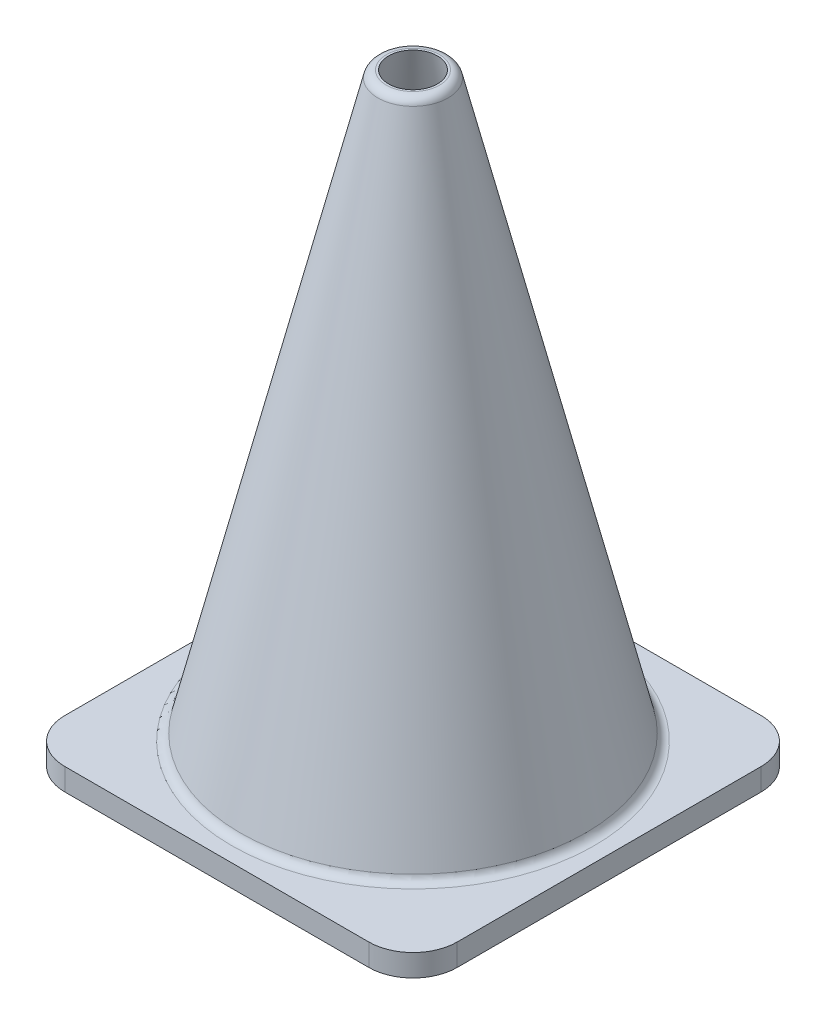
ISO-10303-21;
HEADER;
FILE_DESCRIPTION(('STEP AP214'),'2;1');
FILE_NAME('part.step','',(''),(''),'','','');
FILE_SCHEMA(('AUTOMOTIVE_DESIGN { 1 0 10303 214 1 1 1 1 }'));
ENDSEC;
DATA;
#1=APPLICATION_CONTEXT('core data for automotive mechanical design processes');
#2=APPLICATION_PROTOCOL_DEFINITION('international standard','automotive_design',2000,#1);
#3=PRODUCT_CONTEXT('',#1,'mechanical');
#4=PRODUCT('Part','Part','',(#3));
#5=PRODUCT_RELATED_PRODUCT_CATEGORY('part','',(#4));
#6=PRODUCT_DEFINITION_FORMATION('','',#4);
#7=PRODUCT_DEFINITION_CONTEXT('part definition',#1,'design');
#8=PRODUCT_DEFINITION('design','',#6,#7);
#9=PRODUCT_DEFINITION_SHAPE('','',#8);
#10=(LENGTH_UNIT() NAMED_UNIT(*) SI_UNIT(.MILLI.,.METRE.));
#11=(NAMED_UNIT(*) PLANE_ANGLE_UNIT() SI_UNIT($,.RADIAN.));
#12=(NAMED_UNIT(*) SI_UNIT($,.STERADIAN.) SOLID_ANGLE_UNIT());
#13=UNCERTAINTY_MEASURE_WITH_UNIT(LENGTH_MEASURE(1.E-05),#10,'distance_accuracy_value','');
#14=(GEOMETRIC_REPRESENTATION_CONTEXT(3) GLOBAL_UNCERTAINTY_ASSIGNED_CONTEXT((#13)) GLOBAL_UNIT_ASSIGNED_CONTEXT((#10,
#11,#12)) REPRESENTATION_CONTEXT('',''));
#15=CARTESIAN_POINT('',(0.,0.,0.));
#16=DIRECTION('',(0.,0.,1.));
#17=DIRECTION('',(1.,0.,0.));
#18=AXIS2_PLACEMENT_3D('',#15,#16,#17);
#19=CARTESIAN_POINT('',(0.,50.8,0.));
#20=DIRECTION('',(0.,-1.,0.));
#21=DIRECTION('',(0.,0.,-1.));
#22=AXIS2_PLACEMENT_3D('',#19,#20,#21);
#23=PLANE('',#22);
#24=CARTESIAN_POINT('',(0.,50.8,0.));
#25=DIRECTION('',(0.,-1.,0.));
#26=DIRECTION('',(0.,0.,-1.));
#27=AXIS2_PLACEMENT_3D('',#24,#25,#26);
#28=CIRCLE('',#27,2.31873017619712);
#29=CARTESIAN_POINT('',(0.,50.8,-2.31873017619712));
#30=VERTEX_POINT('',#29);
#31=EDGE_CURVE('E270',#30,#30,#28,.F.);
#32=ORIENTED_EDGE('',*,*,#31,.T.);
#33=EDGE_LOOP('',(#32));
#34=FACE_BOUND('',#33,.T.);
#35=CARTESIAN_POINT('',(0.,50.8,0.));
#36=DIRECTION('',(0.,-1.,0.));
#37=DIRECTION('',(0.,0.,-1.));
#38=AXIS2_PLACEMENT_3D('',#35,#36,#37);
#39=CIRCLE('',#38,2.13155859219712);
#40=CARTESIAN_POINT('',(0.,50.8,-2.13155859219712));
#41=VERTEX_POINT('',#40);
#42=EDGE_CURVE('E195',#41,#41,#39,.F.);
#43=ORIENTED_EDGE('',*,*,#42,.F.);
#44=EDGE_LOOP('',(#43));
#45=FACE_BOUND('',#44,.T.);
#46=ADVANCED_FACE('F32',(#34,#45),#23,.F.);
#47=CARTESIAN_POINT('',(17.145,-1.9304,-17.145));
#48=DIRECTION('',(0.,1.,0.));
#49=DIRECTION('',(0.,0.,1.));
#50=AXIS2_PLACEMENT_3D('',#47,#48,#49);
#51=PLANE('',#50);
#52=DIRECTION('',(-1.,0.,0.));
#53=VECTOR('',#52,1.);
#54=CARTESIAN_POINT('',(17.145,-1.9304,17.145));
#55=LINE('',#54,#53);
#56=CARTESIAN_POINT('',(13.2842,-1.9304,17.145));
#57=VERTEX_POINT('',#56);
#58=CARTESIAN_POINT('',(-13.2842,-1.9304,17.145));
#59=VERTEX_POINT('',#58);
#60=EDGE_CURVE('E217',#57,#59,#55,.T.);
#61=ORIENTED_EDGE('',*,*,#60,.T.);
#62=CARTESIAN_POINT('',(-13.2842,-1.9304,13.2842));
#63=DIRECTION('',(0.,1.,0.));
#64=DIRECTION('',(0.,0.,1.));
#65=AXIS2_PLACEMENT_3D('',#62,#63,#64);
#66=CIRCLE('',#65,3.8608);
#67=CARTESIAN_POINT('',(-17.145,-1.9304,13.2842));
#68=VERTEX_POINT('',#67);
#69=EDGE_CURVE('E259',#59,#68,#66,.F.);
#70=ORIENTED_EDGE('',*,*,#69,.T.);
#71=DIRECTION('',(0.,0.,-1.));
#72=VECTOR('',#71,1.);
#73=CARTESIAN_POINT('',(-17.145,-1.9304,17.145));
#74=LINE('',#73,#72);
#75=CARTESIAN_POINT('',(-17.145,-1.9304,-13.2842));
#76=VERTEX_POINT('',#75);
#77=EDGE_CURVE('E221',#68,#76,#74,.T.);
#78=ORIENTED_EDGE('',*,*,#77,.T.);
#79=CARTESIAN_POINT('',(-13.2842,-1.9304,-13.2842));
#80=DIRECTION('',(0.,1.,0.));
#81=DIRECTION('',(0.,0.,1.));
#82=AXIS2_PLACEMENT_3D('',#79,#80,#81);
#83=CIRCLE('',#82,3.8608);
#84=CARTESIAN_POINT('',(-13.2842,-1.9304,-17.145));
#85=VERTEX_POINT('',#84);
#86=EDGE_CURVE('E253',#76,#85,#83,.F.);
#87=ORIENTED_EDGE('',*,*,#86,.T.);
#88=DIRECTION('',(1.,0.,0.));
#89=VECTOR('',#88,1.);
#90=CARTESIAN_POINT('',(17.145,-1.9304,-17.145));
#91=LINE('',#90,#89);
#92=CARTESIAN_POINT('',(13.2842,-1.9304,-17.145));
#93=VERTEX_POINT('',#92);
#94=EDGE_CURVE('E224',#85,#93,#91,.T.);
#95=ORIENTED_EDGE('',*,*,#94,.T.);
#96=CARTESIAN_POINT('',(13.2842,-1.9304,-13.2842));
#97=DIRECTION('',(0.,1.,0.));
#98=DIRECTION('',(0.,0.,1.));
#99=AXIS2_PLACEMENT_3D('',#96,#97,#98);
#100=CIRCLE('',#99,3.8608);
#101=CARTESIAN_POINT('',(17.145,-1.9304,-13.2842));
#102=VERTEX_POINT('',#101);
#103=EDGE_CURVE('E255',#93,#102,#100,.F.);
#104=ORIENTED_EDGE('',*,*,#103,.T.);
#105=DIRECTION('',(0.,0.,1.));
#106=VECTOR('',#105,1.);
#107=CARTESIAN_POINT('',(17.145,-1.9304,17.145));
#108=LINE('',#107,#106);
#109=CARTESIAN_POINT('',(17.145,-1.9304,13.2842));
#110=VERTEX_POINT('',#109);
#111=EDGE_CURVE('E214',#102,#110,#108,.T.);
#112=ORIENTED_EDGE('',*,*,#111,.T.);
#113=CARTESIAN_POINT('',(13.2842,-1.9304,13.2842));
#114=DIRECTION('',(0.,1.,0.));
#115=DIRECTION('',(0.,0.,1.));
#116=AXIS2_PLACEMENT_3D('',#113,#114,#115);
#117=CIRCLE('',#116,3.8608);
#118=EDGE_CURVE('E257',#110,#57,#117,.F.);
#119=ORIENTED_EDGE('',*,*,#118,.T.);
#120=EDGE_LOOP('',(#61,#70,#78,#87,#95,#104,#112,#119));
#121=FACE_BOUND('',#120,.T.);
#122=DIRECTION('',(-1.,0.,0.));
#123=VECTOR('',#122,1.);
#124=CARTESIAN_POINT('',(17.145,-1.9304,16.37284));
#125=LINE('',#124,#123);
#126=CARTESIAN_POINT('',(13.2842,-1.9304,16.37284));
#127=VERTEX_POINT('',#126);
#128=CARTESIAN_POINT('',(-13.2842,-1.9304,16.37284));
#129=VERTEX_POINT('',#128);
#130=EDGE_CURVE('E174',#127,#129,#125,.T.);
#131=ORIENTED_EDGE('',*,*,#130,.F.);
#132=CARTESIAN_POINT('',(13.2842,-1.9304,13.2842));
#133=DIRECTION('',(0.,1.,0.));
#134=DIRECTION('',(0.,0.,1.));
#135=AXIS2_PLACEMENT_3D('',#132,#133,#134);
#136=CIRCLE('',#135,3.08864);
#137=CARTESIAN_POINT('',(16.37284,-1.9304,13.2842));
#138=VERTEX_POINT('',#137);
#139=EDGE_CURVE('E202',#138,#127,#136,.F.);
#140=ORIENTED_EDGE('',*,*,#139,.F.);
#141=DIRECTION('',(0.,0.,1.));
#142=VECTOR('',#141,1.);
#143=CARTESIAN_POINT('',(16.37284,-1.9304,-17.145));
#144=LINE('',#143,#142);
#145=CARTESIAN_POINT('',(16.37284,-1.9304,-13.2842));
#146=VERTEX_POINT('',#145);
#147=EDGE_CURVE('E47',#146,#138,#144,.T.);
#148=ORIENTED_EDGE('',*,*,#147,.F.);
#149=CARTESIAN_POINT('',(13.2842,-1.9304,-13.2842));
#150=DIRECTION('',(0.,1.,0.));
#151=DIRECTION('',(0.,0.,1.));
#152=AXIS2_PLACEMENT_3D('',#149,#150,#151);
#153=CIRCLE('',#152,3.08864);
#154=CARTESIAN_POINT('',(13.2842,-1.9304,-16.37284));
#155=VERTEX_POINT('',#154);
#156=EDGE_CURVE('E178',#155,#146,#153,.F.);
#157=ORIENTED_EDGE('',*,*,#156,.F.);
#158=DIRECTION('',(1.,0.,0.));
#159=VECTOR('',#158,1.);
#160=CARTESIAN_POINT('',(17.145,-1.9304,-16.37284));
#161=LINE('',#160,#159);
#162=CARTESIAN_POINT('',(-13.2842,-1.9304,-16.37284));
#163=VERTEX_POINT('',#162);
#164=EDGE_CURVE('E187',#163,#155,#161,.T.);
#165=ORIENTED_EDGE('',*,*,#164,.F.);
#166=CARTESIAN_POINT('',(-13.2842,-1.9304,-13.2842));
#167=DIRECTION('',(0.,1.,0.));
#168=DIRECTION('',(0.,0.,1.));
#169=AXIS2_PLACEMENT_3D('',#166,#167,#168);
#170=CIRCLE('',#169,3.08864);
#171=CARTESIAN_POINT('',(-16.37284,-1.9304,-13.2842));
#172=VERTEX_POINT('',#171);
#173=EDGE_CURVE('E176',#172,#163,#170,.F.);
#174=ORIENTED_EDGE('',*,*,#173,.F.);
#175=DIRECTION('',(0.,0.,-1.));
#176=VECTOR('',#175,1.);
#177=CARTESIAN_POINT('',(-16.37284,-1.9304,-17.145));
#178=LINE('',#177,#176);
#179=CARTESIAN_POINT('',(-16.37284,-1.9304,13.2842));
#180=VERTEX_POINT('',#179);
#181=EDGE_CURVE('E206',#180,#172,#178,.T.);
#182=ORIENTED_EDGE('',*,*,#181,.F.);
#183=CARTESIAN_POINT('',(-13.2842,-1.9304,13.2842));
#184=DIRECTION('',(0.,1.,0.));
#185=DIRECTION('',(0.,0.,1.));
#186=AXIS2_PLACEMENT_3D('',#183,#184,#185);
#187=CIRCLE('',#186,3.08864);
#188=EDGE_CURVE('E204',#129,#180,#187,.F.);
#189=ORIENTED_EDGE('',*,*,#188,.F.);
#190=EDGE_LOOP('',(#131,#140,#148,#157,#165,#174,#182,#189));
#191=FACE_BOUND('',#190,.T.);
#192=ADVANCED_FACE('F289',(#121,#191),#51,.F.);
#193=CARTESIAN_POINT('',(0.,0.,0.));
#194=DIRECTION('',(0.,-1.,0.));
#195=DIRECTION('',(0.,0.,-1.));
#196=AXIS2_PLACEMENT_3D('',#193,#194,#195);
#197=CONICAL_SURFACE('',#196,15.24,0.23781303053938);
#198=CARTESIAN_POINT('',(0.,50.2097437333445,0.));
#199=DIRECTION('',(0.,1.,0.));
#200=DIRECTION('',(0.,0.,1.));
#201=AXIS2_PLACEMENT_3D('',#198,#199,#200);
#202=CIRCLE('',#201,3.0691581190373);
#203=CARTESIAN_POINT('',(0.,50.2097437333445,-3.06915811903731));
#204=VERTEX_POINT('',#203);
#205=EDGE_CURVE('E40',#204,#204,#202,.F.);
#206=CARTESIAN_POINT('',(0.,0.590256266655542,0.));
#207=DIRECTION('',(0.,1.,0.));
#208=DIRECTION('',(0.,0.,1.));
#209=AXIS2_PLACEMENT_3D('',#206,#207,#208);
#210=CIRCLE('',#209,15.0969218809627);
#211=CARTESIAN_POINT('',(0.,0.590256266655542,-15.0969218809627));
#212=VERTEX_POINT('',#211);
#213=EDGE_CURVE('E273',#212,#212,#210,.T.);
#214=CARTESIAN_POINT('',(0.,50.2097437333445,-3.06915811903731));
#215=CARTESIAN_POINT('',(0.,49.6928740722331,-3.19444732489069));
#216=CARTESIAN_POINT('',(0.,49.1760044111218,-3.31973653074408));
#217=CARTESIAN_POINT('',(0.,48.1422650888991,-3.57031494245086));
#218=CARTESIAN_POINT('',(0.,47.6253954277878,-3.69560414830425));
#219=CARTESIAN_POINT('',(0.,46.5916561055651,-3.94618256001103));
#220=CARTESIAN_POINT('',(0.,46.0747864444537,-4.07147176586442));
#221=CARTESIAN_POINT('',(0.,45.041047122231,-4.3220501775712));
#222=CARTESIAN_POINT('',(0.,44.5241774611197,-4.44733938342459));
#223=CARTESIAN_POINT('',(0.,43.490438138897,-4.69791779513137));
#224=CARTESIAN_POINT('',(0.,42.9735684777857,-4.82320700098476));
#225=CARTESIAN_POINT('',(0.,41.939829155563,-5.07378541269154));
#226=CARTESIAN_POINT('',(0.,41.4229594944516,-5.19907461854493));
#227=CARTESIAN_POINT('',(0.,40.389220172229,-5.44965303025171));
#228=CARTESIAN_POINT('',(0.,39.8723505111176,-5.5749422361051));
#229=CARTESIAN_POINT('',(0.,38.8386111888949,-5.82552064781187));
#230=CARTESIAN_POINT('',(0.,38.3217415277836,-5.95080985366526));
#231=CARTESIAN_POINT('',(0.,37.2880022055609,-6.20138826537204));
#232=CARTESIAN_POINT('',(0.,36.7711325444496,-6.32667747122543));
#233=CARTESIAN_POINT('',(0.,35.7373932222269,-6.57725588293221));
#234=CARTESIAN_POINT('',(0.,35.2205235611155,-6.7025450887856));
#235=CARTESIAN_POINT('',(0.,34.1867842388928,-6.95312350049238));
#236=CARTESIAN_POINT('',(0.,33.6699145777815,-7.07841270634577));
#237=CARTESIAN_POINT('',(0.,32.6361752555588,-7.32899111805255));
#238=CARTESIAN_POINT('',(0.,32.1193055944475,-7.45428032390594));
#239=CARTESIAN_POINT('',(0.,31.0855662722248,-7.70485873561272));
#240=CARTESIAN_POINT('',(0.,30.5686966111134,-7.83014794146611));
#241=CARTESIAN_POINT('',(0.,29.5349572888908,-8.08072635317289));
#242=CARTESIAN_POINT('',(0.,29.0180876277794,-8.20601555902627));
#243=CARTESIAN_POINT('',(0.,27.9843483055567,-8.45659397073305));
#244=CARTESIAN_POINT('',(0.,27.4674786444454,-8.58188317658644));
#245=CARTESIAN_POINT('',(0.,26.4337393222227,-8.83246158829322));
#246=CARTESIAN_POINT('',(0.,25.9168696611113,-8.95775079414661));
#247=CARTESIAN_POINT('',(0.,24.8831303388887,-9.20832920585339));
#248=CARTESIAN_POINT('',(0.,24.3662606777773,-9.33361841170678));
#249=CARTESIAN_POINT('',(0.,23.3325213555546,-9.58419682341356));
#250=CARTESIAN_POINT('',(0.,22.8156516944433,-9.70948602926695));
#251=CARTESIAN_POINT('',(0.,21.7819123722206,-9.96006444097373));
#252=CARTESIAN_POINT('',(0.,21.2650427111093,-10.0853536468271));
#253=CARTESIAN_POINT('',(0.,20.2313033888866,-10.3359320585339));
#254=CARTESIAN_POINT('',(0.,19.7144337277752,-10.4612212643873));
#255=CARTESIAN_POINT('',(0.,18.6806944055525,-10.7117996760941));
#256=CARTESIAN_POINT('',(0.,18.1638247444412,-10.8370888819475));
#257=CARTESIAN_POINT('',(0.,17.1300854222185,-11.0876672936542));
#258=CARTESIAN_POINT('',(0.,16.6132157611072,-11.2129564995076));
#259=CARTESIAN_POINT('',(0.,15.5794764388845,-11.4635349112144));
#260=CARTESIAN_POINT('',(0.,15.0626067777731,-11.5888241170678));
#261=CARTESIAN_POINT('',(0.,14.0288674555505,-11.8394025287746));
#262=CARTESIAN_POINT('',(0.,13.5119977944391,-11.964691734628));
#263=CARTESIAN_POINT('',(0.,12.4782584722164,-12.2152701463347));
#264=CARTESIAN_POINT('',(0.,11.9613888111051,-12.3405593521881));
#265=CARTESIAN_POINT('',(0.,10.9276494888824,-12.5911377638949));
#266=CARTESIAN_POINT('',(0.,10.4107798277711,-12.7164269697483));
#267=CARTESIAN_POINT('',(0.,9.37704050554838,-12.9670053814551));
#268=CARTESIAN_POINT('',(0.,8.86017084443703,-13.0922945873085));
#269=CARTESIAN_POINT('',(0.,7.82643152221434,-13.3428729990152));
#270=CARTESIAN_POINT('',(0.,7.309561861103,-13.4681622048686));
#271=CARTESIAN_POINT('',(0.,6.27582253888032,-13.7187406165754));
#272=CARTESIAN_POINT('',(0.,5.75895287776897,-13.8440298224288));
#273=CARTESIAN_POINT('',(0.,4.72521355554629,-14.0946082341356));
#274=CARTESIAN_POINT('',(0.,4.20834389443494,-14.219897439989));
#275=CARTESIAN_POINT('',(0.,3.17460457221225,-14.4704758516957));
#276=CARTESIAN_POINT('',(0.,2.65773491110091,-14.5957650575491));
#277=CARTESIAN_POINT('',(0.,1.62399558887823,-14.8463434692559));
#278=CARTESIAN_POINT('',(0.,1.10712592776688,-14.9716326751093));
#279=CARTESIAN_POINT('',(0.,0.590256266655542,-15.0969218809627));
#280=B_SPLINE_CURVE_WITH_KNOTS('',3,(#214,#215,#216,#217,#218,#219,#220,#221,#222,#223,#224,
#225,#226,#227,#228,#229,#230,#231,#232,#233,#234,#235,#236,#237,#238,#239,#240,#241,#242,#243,
#244,#245,#246,#247,#248,#249,#250,#251,#252,#253,#254,#255,#256,#257,#258,#259,#260,#261,#262,
#263,#264,#265,#266,#267,#268,#269,#270,#271,#272,#273,#274,#275,#276,#277,#278,#279),
.UNSPECIFIED.,.F.,.F.,(4,2,2,2,2,2,2,2,2,2,2,2,2,2,2,2,2,2,2,2,2,2,2,2,2,2,2,2,2,2,2,2,4),(0.,
1.59551392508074,3.19102785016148,4.78654177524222,6.38205570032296,7.9775696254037,
9.57308355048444,11.1685974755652,12.7641114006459,14.3596253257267,15.9551392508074,
17.5506531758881,19.1461671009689,20.7416810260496,22.3371949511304,23.9327088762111,
25.5282228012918,27.1237367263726,28.7192506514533,30.314764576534,31.9102785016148,
33.5057924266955,35.1013063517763,36.696820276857,38.2923342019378,39.8878481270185,
41.4833620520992,43.07887597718,44.6743899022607,46.2699038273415,47.8654177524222,
49.460931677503,51.0564456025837),.UNSPECIFIED.);
#281=EDGE_CURVE('BSEAM278',#204,#212,#280,.T.);
#282=ORIENTED_EDGE('',*,*,#205,.T.);
#283=ORIENTED_EDGE('',*,*,#213,.T.);
#284=ORIENTED_EDGE('',*,*,#281,.T.);
#285=ORIENTED_EDGE('',*,*,#281,.F.);
#286=EDGE_LOOP('',(#282,#284,#283,#285));
#287=FACE_BOUND('',#286,.T.);
#288=ADVANCED_FACE('F278',(#287),#197,.T.);
#289=CARTESIAN_POINT('',(17.145,0.,-17.145));
#290=DIRECTION('',(0.,1.,0.));
#291=DIRECTION('',(0.,0.,1.));
#292=AXIS2_PLACEMENT_3D('',#289,#290,#291);
#293=PLANE('',#292);
#294=CARTESIAN_POINT('',(0.,0.,0.));
#295=DIRECTION('',(0.,1.,0.));
#296=DIRECTION('',(0.,0.,1.));
#297=AXIS2_PLACEMENT_3D('',#294,#295,#296);
#298=CIRCLE('',#297,15.8473498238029);
#299=CARTESIAN_POINT('',(0.,0.,15.8473498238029));
#300=VERTEX_POINT('',#299);
#301=EDGE_CURVE('E11',#300,#300,#298,.F.);
#302=ORIENTED_EDGE('',*,*,#301,.T.);
#303=EDGE_LOOP('',(#302));
#304=FACE_BOUND('',#303,.T.);
#305=DIRECTION('',(0.,0.,-1.));
#306=VECTOR('',#305,1.);
#307=CARTESIAN_POINT('',(-17.145,0.,17.145));
#308=LINE('',#307,#306);
#309=CARTESIAN_POINT('',(-17.145,0.,13.2842));
#310=VERTEX_POINT('',#309);
#311=CARTESIAN_POINT('',(-17.145,0.,-13.2842));
#312=VERTEX_POINT('',#311);
#313=EDGE_CURVE('E232',#310,#312,#308,.T.);
#314=ORIENTED_EDGE('',*,*,#313,.F.);
#315=CARTESIAN_POINT('',(-13.2842,0.,13.2842));
#316=DIRECTION('',(0.,1.,0.));
#317=DIRECTION('',(0.,0.,1.));
#318=AXIS2_PLACEMENT_3D('',#315,#316,#317);
#319=CIRCLE('',#318,3.8608);
#320=CARTESIAN_POINT('',(-13.2842,0.,17.145));
#321=VERTEX_POINT('',#320);
#322=EDGE_CURVE('E246',#310,#321,#319,.T.);
#323=ORIENTED_EDGE('',*,*,#322,.T.);
#324=DIRECTION('',(-1.,0.,0.));
#325=VECTOR('',#324,1.);
#326=CARTESIAN_POINT('',(17.145,0.,17.145));
#327=LINE('',#326,#325);
#328=CARTESIAN_POINT('',(13.2842,0.,17.145));
#329=VERTEX_POINT('',#328);
#330=EDGE_CURVE('E229',#329,#321,#327,.T.);
#331=ORIENTED_EDGE('',*,*,#330,.F.);
#332=CARTESIAN_POINT('',(13.2842,0.,13.2842));
#333=DIRECTION('',(0.,1.,0.));
#334=DIRECTION('',(0.,0.,1.));
#335=AXIS2_PLACEMENT_3D('',#332,#333,#334);
#336=CIRCLE('',#335,3.8608);
#337=CARTESIAN_POINT('',(17.145,0.,13.2842));
#338=VERTEX_POINT('',#337);
#339=EDGE_CURVE('E244',#329,#338,#336,.T.);
#340=ORIENTED_EDGE('',*,*,#339,.T.);
#341=DIRECTION('',(0.,0.,1.));
#342=VECTOR('',#341,1.);
#343=CARTESIAN_POINT('',(17.145,0.,17.145));
#344=LINE('',#343,#342);
#345=CARTESIAN_POINT('',(17.145,0.,-13.2842));
#346=VERTEX_POINT('',#345);
#347=EDGE_CURVE('E198',#346,#338,#344,.T.);
#348=ORIENTED_EDGE('',*,*,#347,.F.);
#349=CARTESIAN_POINT('',(13.2842,0.,-13.2842));
#350=DIRECTION('',(0.,1.,0.));
#351=DIRECTION('',(0.,0.,1.));
#352=AXIS2_PLACEMENT_3D('',#349,#350,#351);
#353=CIRCLE('',#352,3.8608);
#354=CARTESIAN_POINT('',(13.2842,0.,-17.145));
#355=VERTEX_POINT('',#354);
#356=EDGE_CURVE('E242',#346,#355,#353,.T.);
#357=ORIENTED_EDGE('',*,*,#356,.T.);
#358=DIRECTION('',(1.,0.,0.));
#359=VECTOR('',#358,1.);
#360=CARTESIAN_POINT('',(17.145,0.,-17.145));
#361=LINE('',#360,#359);
#362=CARTESIAN_POINT('',(-13.2842,0.,-17.145));
#363=VERTEX_POINT('',#362);
#364=EDGE_CURVE('E218',#363,#355,#361,.T.);
#365=ORIENTED_EDGE('',*,*,#364,.F.);
#366=CARTESIAN_POINT('',(-13.2842,0.,-13.2842));
#367=DIRECTION('',(0.,1.,0.));
#368=DIRECTION('',(0.,0.,1.));
#369=AXIS2_PLACEMENT_3D('',#366,#367,#368);
#370=CIRCLE('',#369,3.8608);
#371=EDGE_CURVE('E240',#363,#312,#370,.T.);
#372=ORIENTED_EDGE('',*,*,#371,.T.);
#373=EDGE_LOOP('',(#314,#323,#331,#340,#348,#357,#365,#372));
#374=FACE_BOUND('',#373,.T.);
#375=ADVANCED_FACE('F350',(#304,#374),#293,.T.);
#376=CARTESIAN_POINT('',(17.145,-1.9304,17.145));
#377=DIRECTION('',(-1.,0.,0.));
#378=DIRECTION('',(0.,0.,1.));
#379=AXIS2_PLACEMENT_3D('',#376,#377,#378);
#380=PLANE('',#379);
#381=ORIENTED_EDGE('',*,*,#347,.T.);
#382=DIRECTION('',(0.,1.,0.));
#383=VECTOR('',#382,1.);
#384=CARTESIAN_POINT('',(17.145,-1.9304,13.2842));
#385=LINE('',#384,#383);
#386=EDGE_CURVE('E264',#338,#110,#385,.F.);
#387=ORIENTED_EDGE('',*,*,#386,.T.);
#388=ORIENTED_EDGE('',*,*,#111,.F.);
#389=DIRECTION('',(0.,1.,0.));
#390=VECTOR('',#389,1.);
#391=CARTESIAN_POINT('',(17.145,-1.9304,-13.2842));
#392=LINE('',#391,#390);
#393=EDGE_CURVE('E261',#102,#346,#392,.T.);
#394=ORIENTED_EDGE('',*,*,#393,.T.);
#395=EDGE_LOOP('',(#381,#387,#388,#394));
#396=FACE_BOUND('',#395,.T.);
#397=ADVANCED_FACE('F353',(#396),#380,.F.);
#398=CARTESIAN_POINT('',(17.145,-1.9304,17.145));
#399=DIRECTION('',(0.,0.,-1.));
#400=DIRECTION('',(-1.,0.,0.));
#401=AXIS2_PLACEMENT_3D('',#398,#399,#400);
#402=PLANE('',#401);
#403=ORIENTED_EDGE('',*,*,#330,.T.);
#404=DIRECTION('',(0.,1.,0.));
#405=VECTOR('',#404,1.);
#406=CARTESIAN_POINT('',(-13.2842,-1.9304,17.145));
#407=LINE('',#406,#405);
#408=EDGE_CURVE('E251',#321,#59,#407,.F.);
#409=ORIENTED_EDGE('',*,*,#408,.T.);
#410=ORIENTED_EDGE('',*,*,#60,.F.);
#411=DIRECTION('',(0.,1.,0.));
#412=VECTOR('',#411,1.);
#413=CARTESIAN_POINT('',(13.2842,-1.9304,17.145));
#414=LINE('',#413,#412);
#415=EDGE_CURVE('E248',#57,#329,#414,.T.);
#416=ORIENTED_EDGE('',*,*,#415,.T.);
#417=EDGE_LOOP('',(#403,#409,#410,#416));
#418=FACE_BOUND('',#417,.T.);
#419=ADVANCED_FACE('F362',(#418),#402,.F.);
#420=CARTESIAN_POINT('',(-17.145,-1.9304,17.145));
#421=DIRECTION('',(1.,0.,0.));
#422=DIRECTION('',(0.,0.,-1.));
#423=AXIS2_PLACEMENT_3D('',#420,#421,#422);
#424=PLANE('',#423);
#425=ORIENTED_EDGE('',*,*,#77,.F.);
#426=DIRECTION('',(0.,1.,0.));
#427=VECTOR('',#426,1.);
#428=CARTESIAN_POINT('',(-17.145,-1.9304,13.2842));
#429=LINE('',#428,#427);
#430=EDGE_CURVE('E237',#68,#310,#429,.T.);
#431=ORIENTED_EDGE('',*,*,#430,.T.);
#432=ORIENTED_EDGE('',*,*,#313,.T.);
#433=DIRECTION('',(0.,1.,0.));
#434=VECTOR('',#433,1.);
#435=CARTESIAN_POINT('',(-17.145,-1.9304,-13.2842));
#436=LINE('',#435,#434);
#437=EDGE_CURVE('E226',#312,#76,#436,.F.);
#438=ORIENTED_EDGE('',*,*,#437,.T.);
#439=EDGE_LOOP('',(#425,#431,#432,#438));
#440=FACE_BOUND('',#439,.T.);
#441=ADVANCED_FACE('F359',(#440),#424,.F.);
#442=CARTESIAN_POINT('',(17.145,-1.9304,-17.145));
#443=DIRECTION('',(0.,0.,1.));
#444=DIRECTION('',(1.,0.,0.));
#445=AXIS2_PLACEMENT_3D('',#442,#443,#444);
#446=PLANE('',#445);
#447=ORIENTED_EDGE('',*,*,#364,.T.);
#448=DIRECTION('',(0.,1.,0.));
#449=VECTOR('',#448,1.);
#450=CARTESIAN_POINT('',(13.2842,-1.9304,-17.145));
#451=LINE('',#450,#449);
#452=EDGE_CURVE('E55',#355,#93,#451,.F.);
#453=ORIENTED_EDGE('',*,*,#452,.T.);
#454=ORIENTED_EDGE('',*,*,#94,.F.);
#455=DIRECTION('',(0.,1.,0.));
#456=VECTOR('',#455,1.);
#457=CARTESIAN_POINT('',(-13.2842,-1.9304,-17.145));
#458=LINE('',#457,#456);
#459=EDGE_CURVE('E266',#85,#363,#458,.T.);
#460=ORIENTED_EDGE('',*,*,#459,.T.);
#461=EDGE_LOOP('',(#447,#453,#454,#460));
#462=FACE_BOUND('',#461,.T.);
#463=ADVANCED_FACE('F355',(#462),#446,.F.);
#464=CARTESIAN_POINT('',(-13.2842,-1.9304,13.2842));
#465=DIRECTION('',(0.,1.,0.));
#466=DIRECTION('',(0.,0.,1.));
#467=AXIS2_PLACEMENT_3D('',#464,#465,#466);
#468=CYLINDRICAL_SURFACE('',#467,3.8608);
#469=ORIENTED_EDGE('',*,*,#69,.F.);
#470=ORIENTED_EDGE('',*,*,#408,.F.);
#471=ORIENTED_EDGE('',*,*,#322,.F.);
#472=ORIENTED_EDGE('',*,*,#430,.F.);
#473=EDGE_LOOP('',(#469,#470,#471,#472));
#474=FACE_BOUND('',#473,.T.);
#475=ADVANCED_FACE('F358',(#474),#468,.T.);
#476=CARTESIAN_POINT('',(13.2842,-1.9304,13.2842));
#477=DIRECTION('',(0.,1.,0.));
#478=DIRECTION('',(0.,0.,1.));
#479=AXIS2_PLACEMENT_3D('',#476,#477,#478);
#480=CYLINDRICAL_SURFACE('',#479,3.8608);
#481=ORIENTED_EDGE('',*,*,#118,.F.);
#482=ORIENTED_EDGE('',*,*,#386,.F.);
#483=ORIENTED_EDGE('',*,*,#339,.F.);
#484=ORIENTED_EDGE('',*,*,#415,.F.);
#485=EDGE_LOOP('',(#481,#482,#483,#484));
#486=FACE_BOUND('',#485,.T.);
#487=ADVANCED_FACE('F374',(#486),#480,.T.);
#488=CARTESIAN_POINT('',(13.2842,-1.9304,-13.2842));
#489=DIRECTION('',(0.,1.,0.));
#490=DIRECTION('',(0.,0.,1.));
#491=AXIS2_PLACEMENT_3D('',#488,#489,#490);
#492=CYLINDRICAL_SURFACE('',#491,3.8608);
#493=ORIENTED_EDGE('',*,*,#103,.F.);
#494=ORIENTED_EDGE('',*,*,#452,.F.);
#495=ORIENTED_EDGE('',*,*,#356,.F.);
#496=ORIENTED_EDGE('',*,*,#393,.F.);
#497=EDGE_LOOP('',(#493,#494,#495,#496));
#498=FACE_BOUND('',#497,.T.);
#499=ADVANCED_FACE('F378',(#498),#492,.T.);
#500=CARTESIAN_POINT('',(-13.2842,-1.9304,-13.2842));
#501=DIRECTION('',(0.,1.,0.));
#502=DIRECTION('',(0.,0.,1.));
#503=AXIS2_PLACEMENT_3D('',#500,#501,#502);
#504=CYLINDRICAL_SURFACE('',#503,3.8608);
#505=ORIENTED_EDGE('',*,*,#86,.F.);
#506=ORIENTED_EDGE('',*,*,#437,.F.);
#507=ORIENTED_EDGE('',*,*,#371,.F.);
#508=ORIENTED_EDGE('',*,*,#459,.F.);
#509=EDGE_LOOP('',(#505,#506,#507,#508));
#510=FACE_BOUND('',#509,.T.);
#511=ADVANCED_FACE('F284',(#510),#504,.T.);
#512=CARTESIAN_POINT('',(0.,50.02784,0.));
#513=DIRECTION('',(0.,-1.,0.));
#514=DIRECTION('',(0.,0.,-1.));
#515=AXIS2_PLACEMENT_3D('',#512,#513,#514);
#516=TOROIDAL_SURFACE('',#515,2.31873017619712,0.77216);
#517=ORIENTED_EDGE('',*,*,#205,.F.);
#518=EDGE_LOOP('',(#517));
#519=FACE_BOUND('',#518,.T.);
#520=ORIENTED_EDGE('',*,*,#31,.F.);
#521=EDGE_LOOP('',(#520));
#522=FACE_BOUND('',#521,.T.);
#523=ADVANCED_FACE('F281',(#519,#522),#516,.T.);
#524=CARTESIAN_POINT('',(0.,0.77216,0.));
#525=DIRECTION('',(0.,1.,0.));
#526=DIRECTION('',(0.,0.,1.));
#527=AXIS2_PLACEMENT_3D('',#524,#525,#526);
#528=TOROIDAL_SURFACE('',#527,15.8473498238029,0.77216);
#529=ORIENTED_EDGE('',*,*,#301,.F.);
#530=EDGE_LOOP('',(#529));
#531=FACE_BOUND('',#530,.T.);
#532=ORIENTED_EDGE('',*,*,#213,.F.);
#533=EDGE_LOOP('',(#532));
#534=FACE_BOUND('',#533,.T.);
#535=ADVANCED_FACE('F34',(#531,#534),#528,.F.);
#536=CARTESIAN_POINT('',(0.,-0.181903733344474,0.));
#537=DIRECTION('',(0.,-1.,0.));
#538=DIRECTION('',(0.,0.,-1.));
#539=AXIS2_PLACEMENT_3D('',#536,#537,#538);
#540=CONICAL_SURFACE('',#539,14.4895720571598,0.23781303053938);
#541=CARTESIAN_POINT('',(0.,0.408352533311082,0.));
#542=DIRECTION('',(0.,-1.,0.));
#543=DIRECTION('',(0.,0.,-1.));
#544=AXIS2_PLACEMENT_3D('',#541,#542,#543);
#545=CIRCLE('',#544,14.3464939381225);
#546=CARTESIAN_POINT('',(0.,0.408352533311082,-14.3464939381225));
#547=VERTEX_POINT('',#546);
#548=EDGE_CURVE('E194',#547,#547,#545,.F.);
#549=CARTESIAN_POINT('',(0.,50.8,-2.13155859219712));
#550=CARTESIAN_POINT('',(0.,50.2750870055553,-2.25879750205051));
#551=CARTESIAN_POINT('',(0.,49.7501740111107,-2.3860364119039));
#552=CARTESIAN_POINT('',(0.,48.7003480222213,-2.64051423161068));
#553=CARTESIAN_POINT('',(0.,48.1754350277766,-2.76775314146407));
#554=CARTESIAN_POINT('',(0.,47.1256090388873,-3.02223096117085));
#555=CARTESIAN_POINT('',(0.,46.6006960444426,-3.14946987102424));
#556=CARTESIAN_POINT('',(0.,45.5508700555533,-3.40394769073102));
#557=CARTESIAN_POINT('',(0.,45.0259570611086,-3.5311866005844));
#558=CARTESIAN_POINT('',(0.,43.9761310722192,-3.78566442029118));
#559=CARTESIAN_POINT('',(0.,43.4512180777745,-3.91290333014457));
#560=CARTESIAN_POINT('',(0.,42.4013920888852,-4.16738114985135));
#561=CARTESIAN_POINT('',(0.,41.8764790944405,-4.29462005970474));
#562=CARTESIAN_POINT('',(0.,40.8266531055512,-4.54909787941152));
#563=CARTESIAN_POINT('',(0.,40.3017401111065,-4.67633678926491));
#564=CARTESIAN_POINT('',(0.,39.2519141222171,-4.93081460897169));
#565=CARTESIAN_POINT('',(0.,38.7270011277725,-5.05805351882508));
#566=CARTESIAN_POINT('',(0.,37.6771751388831,-5.31253133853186));
#567=CARTESIAN_POINT('',(0.,37.1522621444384,-5.43977024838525));
#568=CARTESIAN_POINT('',(0.,36.1024361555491,-5.69424806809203));
#569=CARTESIAN_POINT('',(0.,35.5775231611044,-5.82148697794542));
#570=CARTESIAN_POINT('',(0.,34.527697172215,-6.0759647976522));
#571=CARTESIAN_POINT('',(0.,34.0027841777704,-6.20320370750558));
#572=CARTESIAN_POINT('',(0.,32.952958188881,-6.45768152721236));
#573=CARTESIAN_POINT('',(0.,32.4280451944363,-6.58492043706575));
#574=CARTESIAN_POINT('',(0.,31.378219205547,-6.83939825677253));
#575=CARTESIAN_POINT('',(0.,30.8533062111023,-6.96663716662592));
#576=CARTESIAN_POINT('',(0.,29.803480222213,-7.2211149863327));
#577=CARTESIAN_POINT('',(0.,29.2785672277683,-7.34835389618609));
#578=CARTESIAN_POINT('',(0.,28.2287412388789,-7.60283171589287));
#579=CARTESIAN_POINT('',(0.,27.7038282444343,-7.73007062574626));
#580=CARTESIAN_POINT('',(0.,26.6540022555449,-7.98454844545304));
#581=CARTESIAN_POINT('',(0.,26.1290892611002,-8.11178735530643));
#582=CARTESIAN_POINT('',(0.,25.0792632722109,-8.36626517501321));
#583=CARTESIAN_POINT('',(0.,24.5543502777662,-8.4935040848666));
#584=CARTESIAN_POINT('',(0.,23.5045242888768,-8.74798190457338));
#585=CARTESIAN_POINT('',(0.,22.9796112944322,-8.87522081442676));
#586=CARTESIAN_POINT('',(0.,21.9297853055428,-9.12969863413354));
#587=CARTESIAN_POINT('',(0.,21.4048723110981,-9.25693754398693));
#588=CARTESIAN_POINT('',(0.,20.3550463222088,-9.51141536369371));
#589=CARTESIAN_POINT('',(0.,19.8301333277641,-9.6386542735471));
#590=CARTESIAN_POINT('',(0.,18.7803073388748,-9.89313209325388));
#591=CARTESIAN_POINT('',(0.,18.2553943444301,-10.0203710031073));
#592=CARTESIAN_POINT('',(0.,17.2055683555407,-10.2748488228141));
#593=CARTESIAN_POINT('',(0.,16.6806553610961,-10.4020877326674));
#594=CARTESIAN_POINT('',(0.,15.6308293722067,-10.6565655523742));
#595=CARTESIAN_POINT('',(0.,15.105916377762,-10.7838044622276));
#596=CARTESIAN_POINT('',(0.,14.0560903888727,-11.0382822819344));
#597=CARTESIAN_POINT('',(0.,13.531177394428,-11.1655211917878));
#598=CARTESIAN_POINT('',(0.,12.4813514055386,-11.4199990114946));
#599=CARTESIAN_POINT('',(0.,11.956438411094,-11.5472379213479));
#600=CARTESIAN_POINT('',(0.,10.9066124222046,-11.8017157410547));
#601=CARTESIAN_POINT('',(0.,10.3816994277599,-11.9289546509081));
#602=CARTESIAN_POINT('',(0.,9.33187343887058,-12.1834324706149));
#603=CARTESIAN_POINT('',(0.,8.8069604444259,-12.3106713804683));
#604=CARTESIAN_POINT('',(0.,7.75713445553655,-12.5651492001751));
#605=CARTESIAN_POINT('',(0.,7.23222146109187,-12.6923881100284));
#606=CARTESIAN_POINT('',(0.,6.18239547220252,-12.9468659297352));
#607=CARTESIAN_POINT('',(0.,5.65748247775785,-13.0741048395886));
#608=CARTESIAN_POINT('',(0.,4.60765648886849,-13.3285826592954));
#609=CARTESIAN_POINT('',(0.,4.08274349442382,-13.4558215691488));
#610=CARTESIAN_POINT('',(0.,3.03291750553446,-13.7102993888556));
#611=CARTESIAN_POINT('',(0.,2.50800451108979,-13.837538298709));
#612=CARTESIAN_POINT('',(0.,1.45817852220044,-14.0920161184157));
#613=CARTESIAN_POINT('',(0.,0.933265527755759,-14.2192550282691));
#614=CARTESIAN_POINT('',(0.,0.408352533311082,-14.3464939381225));
#615=B_SPLINE_CURVE_WITH_KNOTS('',3,(#549,#550,#551,#552,#553,#554,#555,#556,#557,#558,#559,
#560,#561,#562,#563,#564,#565,#566,#567,#568,#569,#570,#571,#572,#573,#574,#575,#576,#577,#578,
#579,#580,#581,#582,#583,#584,#585,#586,#587,#588,#589,#590,#591,#592,#593,#594,#595,#596,#597,
#598,#599,#600,#601,#602,#603,#604,#605,#606,#607,#608,#609,#610,#611,#612,#613,#614),
.UNSPECIFIED.,.F.,.F.,(4,2,2,2,2,2,2,2,2,2,2,2,2,2,2,2,2,2,2,2,2,2,2,2,2,2,2,2,2,2,2,2,4),(0.,
1.62034271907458,3.24068543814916,4.86102815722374,6.48137087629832,8.10171359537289,
9.72205631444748,11.3423990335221,12.9627417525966,14.5830844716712,16.2034271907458,
17.8237699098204,19.444112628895,21.0644553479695,22.6847980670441,24.3051407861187,
25.9254835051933,27.5458262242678,29.1661689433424,30.786511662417,32.4068543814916,
34.0271971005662,35.6475398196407,37.2678825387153,38.8882252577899,40.5085679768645,
42.1289106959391,43.7492534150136,45.3695961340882,46.9899388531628,48.6102815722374,
50.230624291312,51.8509670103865),.UNSPECIFIED.);
#616=EDGE_CURVE('BSEAM293',#41,#547,#615,.T.);
#617=ORIENTED_EDGE('',*,*,#42,.T.);
#618=ORIENTED_EDGE('',*,*,#548,.F.);
#619=ORIENTED_EDGE('',*,*,#616,.T.);
#620=ORIENTED_EDGE('',*,*,#616,.F.);
#621=EDGE_LOOP('',(#617,#619,#618,#620));
#622=FACE_BOUND('',#621,.T.);
#623=ADVANCED_FACE('F293',(#622),#540,.F.);
#624=CARTESIAN_POINT('',(17.145,-0.77216,-17.145));
#625=DIRECTION('',(0.,1.,0.));
#626=DIRECTION('',(0.,0.,1.));
#627=AXIS2_PLACEMENT_3D('',#624,#625,#626);
#628=PLANE('',#627);
#629=CARTESIAN_POINT('',(0.,-0.77216,0.));
#630=DIRECTION('',(0.,1.,0.));
#631=DIRECTION('',(0.,0.,1.));
#632=AXIS2_PLACEMENT_3D('',#629,#630,#631);
#633=CIRCLE('',#632,15.8473498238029);
#634=CARTESIAN_POINT('',(0.,-0.77216,15.8473498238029));
#635=VERTEX_POINT('',#634);
#636=EDGE_CURVE('E199',#635,#635,#633,.F.);
#637=ORIENTED_EDGE('',*,*,#636,.F.);
#638=EDGE_LOOP('',(#637));
#639=FACE_BOUND('',#638,.T.);
#640=DIRECTION('',(0.,0.,-1.));
#641=VECTOR('',#640,1.);
#642=CARTESIAN_POINT('',(-16.37284,-0.77216,-17.145));
#643=LINE('',#642,#641);
#644=CARTESIAN_POINT('',(-16.37284,-0.77216,13.2842));
#645=VERTEX_POINT('',#644);
#646=CARTESIAN_POINT('',(-16.37284,-0.77216,-13.2842));
#647=VERTEX_POINT('',#646);
#648=EDGE_CURVE('E169',#645,#647,#643,.T.);
#649=ORIENTED_EDGE('',*,*,#648,.T.);
#650=CARTESIAN_POINT('',(-13.2842,-0.77216,-13.2842));
#651=DIRECTION('',(0.,1.,0.));
#652=DIRECTION('',(0.,0.,1.));
#653=AXIS2_PLACEMENT_3D('',#650,#651,#652);
#654=CIRCLE('',#653,3.08864);
#655=CARTESIAN_POINT('',(-13.2842,-0.77216,-16.37284));
#656=VERTEX_POINT('',#655);
#657=EDGE_CURVE('E184',#656,#647,#654,.T.);
#658=ORIENTED_EDGE('',*,*,#657,.F.);
#659=DIRECTION('',(1.,0.,0.));
#660=VECTOR('',#659,1.);
#661=CARTESIAN_POINT('',(17.145,-0.77216,-16.37284));
#662=LINE('',#661,#660);
#663=CARTESIAN_POINT('',(13.2842,-0.77216,-16.37284));
#664=VERTEX_POINT('',#663);
#665=EDGE_CURVE('E201',#656,#664,#662,.T.);
#666=ORIENTED_EDGE('',*,*,#665,.T.);
#667=CARTESIAN_POINT('',(13.2842,-0.77216,-13.2842));
#668=DIRECTION('',(0.,1.,0.));
#669=DIRECTION('',(0.,0.,1.));
#670=AXIS2_PLACEMENT_3D('',#667,#668,#669);
#671=CIRCLE('',#670,3.08864);
#672=CARTESIAN_POINT('',(16.37284,-0.77216,-13.2842));
#673=VERTEX_POINT('',#672);
#674=EDGE_CURVE('E306',#673,#664,#671,.T.);
#675=ORIENTED_EDGE('',*,*,#674,.F.);
#676=DIRECTION('',(0.,0.,1.));
#677=VECTOR('',#676,1.);
#678=CARTESIAN_POINT('',(16.37284,-0.77216,-17.145));
#679=LINE('',#678,#677);
#680=CARTESIAN_POINT('',(16.37284,-0.77216,13.2842));
#681=VERTEX_POINT('',#680);
#682=EDGE_CURVE('E170',#673,#681,#679,.T.);
#683=ORIENTED_EDGE('',*,*,#682,.T.);
#684=CARTESIAN_POINT('',(13.2842,-0.77216,13.2842));
#685=DIRECTION('',(0.,1.,0.));
#686=DIRECTION('',(0.,0.,1.));
#687=AXIS2_PLACEMENT_3D('',#684,#685,#686);
#688=CIRCLE('',#687,3.08864);
#689=CARTESIAN_POINT('',(13.2842,-0.77216,16.37284));
#690=VERTEX_POINT('',#689);
#691=EDGE_CURVE('E160',#690,#681,#688,.T.);
#692=ORIENTED_EDGE('',*,*,#691,.F.);
#693=DIRECTION('',(-1.,0.,0.));
#694=VECTOR('',#693,1.);
#695=CARTESIAN_POINT('',(17.145,-0.77216,16.37284));
#696=LINE('',#695,#694);
#697=CARTESIAN_POINT('',(-13.2842,-0.77216,16.37284));
#698=VERTEX_POINT('',#697);
#699=EDGE_CURVE('E163',#690,#698,#696,.T.);
#700=ORIENTED_EDGE('',*,*,#699,.T.);
#701=CARTESIAN_POINT('',(-13.2842,-0.77216,13.2842));
#702=DIRECTION('',(0.,1.,0.));
#703=DIRECTION('',(0.,0.,1.));
#704=AXIS2_PLACEMENT_3D('',#701,#702,#703);
#705=CIRCLE('',#704,3.08864);
#706=EDGE_CURVE('E148',#645,#698,#705,.T.);
#707=ORIENTED_EDGE('',*,*,#706,.F.);
#708=EDGE_LOOP('',(#649,#658,#666,#675,#683,#692,#700,#707));
#709=FACE_BOUND('',#708,.T.);
#710=ADVANCED_FACE('F164',(#639,#709),#628,.F.);
#711=CARTESIAN_POINT('',(16.37284,-1.9304,17.145));
#712=DIRECTION('',(-1.,0.,0.));
#713=DIRECTION('',(0.,0.,1.));
#714=AXIS2_PLACEMENT_3D('',#711,#712,#713);
#715=PLANE('',#714);
#716=ORIENTED_EDGE('',*,*,#682,.F.);
#717=DIRECTION('',(0.,1.,0.));
#718=VECTOR('',#717,1.);
#719=CARTESIAN_POINT('',(16.37284,-1.9304,-13.2842));
#720=LINE('',#719,#718);
#721=EDGE_CURVE('E208',#146,#673,#720,.T.);
#722=ORIENTED_EDGE('',*,*,#721,.F.);
#723=ORIENTED_EDGE('',*,*,#147,.T.);
#724=DIRECTION('',(0.,1.,0.));
#725=VECTOR('',#724,1.);
#726=CARTESIAN_POINT('',(16.37284,-1.9304,13.2842));
#727=LINE('',#726,#725);
#728=EDGE_CURVE('E192',#681,#138,#727,.F.);
#729=ORIENTED_EDGE('',*,*,#728,.F.);
#730=EDGE_LOOP('',(#716,#722,#723,#729));
#731=FACE_BOUND('',#730,.T.);
#732=ADVANCED_FACE('F317',(#731),#715,.T.);
#733=CARTESIAN_POINT('',(17.145,-1.9304,16.37284));
#734=DIRECTION('',(0.,0.,-1.));
#735=DIRECTION('',(-1.,0.,0.));
#736=AXIS2_PLACEMENT_3D('',#733,#734,#735);
#737=PLANE('',#736);
#738=ORIENTED_EDGE('',*,*,#699,.F.);
#739=DIRECTION('',(0.,1.,0.));
#740=VECTOR('',#739,1.);
#741=CARTESIAN_POINT('',(13.2842,-1.9304,16.37284));
#742=LINE('',#741,#740);
#743=EDGE_CURVE('E159',#127,#690,#742,.T.);
#744=ORIENTED_EDGE('',*,*,#743,.F.);
#745=ORIENTED_EDGE('',*,*,#130,.T.);
#746=DIRECTION('',(0.,1.,0.));
#747=VECTOR('',#746,1.);
#748=CARTESIAN_POINT('',(-13.2842,-1.9304,16.37284));
#749=LINE('',#748,#747);
#750=EDGE_CURVE('E152',#698,#129,#749,.F.);
#751=ORIENTED_EDGE('',*,*,#750,.F.);
#752=EDGE_LOOP('',(#738,#744,#745,#751));
#753=FACE_BOUND('',#752,.T.);
#754=ADVANCED_FACE('F172',(#753),#737,.T.);
#755=CARTESIAN_POINT('',(-16.37284,-1.9304,17.145));
#756=DIRECTION('',(1.,0.,0.));
#757=DIRECTION('',(0.,0.,-1.));
#758=AXIS2_PLACEMENT_3D('',#755,#756,#757);
#759=PLANE('',#758);
#760=ORIENTED_EDGE('',*,*,#181,.T.);
#761=DIRECTION('',(0.,1.,0.));
#762=VECTOR('',#761,1.);
#763=CARTESIAN_POINT('',(-16.37284,-1.9304,-13.2842));
#764=LINE('',#763,#762);
#765=EDGE_CURVE('E185',#647,#172,#764,.F.);
#766=ORIENTED_EDGE('',*,*,#765,.F.);
#767=ORIENTED_EDGE('',*,*,#648,.F.);
#768=DIRECTION('',(0.,1.,0.));
#769=VECTOR('',#768,1.);
#770=CARTESIAN_POINT('',(-16.37284,-1.9304,13.2842));
#771=LINE('',#770,#769);
#772=EDGE_CURVE('E155',#180,#645,#771,.T.);
#773=ORIENTED_EDGE('',*,*,#772,.F.);
#774=EDGE_LOOP('',(#760,#766,#767,#773));
#775=FACE_BOUND('',#774,.T.);
#776=ADVANCED_FACE('F445',(#775),#759,.T.);
#777=CARTESIAN_POINT('',(17.145,-1.9304,-16.37284));
#778=DIRECTION('',(0.,0.,1.));
#779=DIRECTION('',(1.,0.,0.));
#780=AXIS2_PLACEMENT_3D('',#777,#778,#779);
#781=PLANE('',#780);
#782=ORIENTED_EDGE('',*,*,#665,.F.);
#783=DIRECTION('',(0.,1.,0.));
#784=VECTOR('',#783,1.);
#785=CARTESIAN_POINT('',(-13.2842,-1.9304,-16.37284));
#786=LINE('',#785,#784);
#787=EDGE_CURVE('E188',#163,#656,#786,.T.);
#788=ORIENTED_EDGE('',*,*,#787,.F.);
#789=ORIENTED_EDGE('',*,*,#164,.T.);
#790=DIRECTION('',(0.,1.,0.));
#791=VECTOR('',#790,1.);
#792=CARTESIAN_POINT('',(13.2842,-1.9304,-16.37284));
#793=LINE('',#792,#791);
#794=EDGE_CURVE('E191',#664,#155,#793,.F.);
#795=ORIENTED_EDGE('',*,*,#794,.F.);
#796=EDGE_LOOP('',(#782,#788,#789,#795));
#797=FACE_BOUND('',#796,.T.);
#798=ADVANCED_FACE('F322',(#797),#781,.T.);
#799=CARTESIAN_POINT('',(-13.2842,-1.9304,13.2842));
#800=DIRECTION('',(0.,1.,0.));
#801=DIRECTION('',(0.,0.,1.));
#802=AXIS2_PLACEMENT_3D('',#799,#800,#801);
#803=CYLINDRICAL_SURFACE('',#802,3.08864);
#804=ORIENTED_EDGE('',*,*,#188,.T.);
#805=ORIENTED_EDGE('',*,*,#772,.T.);
#806=ORIENTED_EDGE('',*,*,#706,.T.);
#807=ORIENTED_EDGE('',*,*,#750,.T.);
#808=EDGE_LOOP('',(#804,#805,#806,#807));
#809=FACE_BOUND('',#808,.T.);
#810=ADVANCED_FACE('F150',(#809),#803,.F.);
#811=CARTESIAN_POINT('',(13.2842,-1.9304,13.2842));
#812=DIRECTION('',(0.,1.,0.));
#813=DIRECTION('',(0.,0.,1.));
#814=AXIS2_PLACEMENT_3D('',#811,#812,#813);
#815=CYLINDRICAL_SURFACE('',#814,3.08864);
#816=ORIENTED_EDGE('',*,*,#139,.T.);
#817=ORIENTED_EDGE('',*,*,#743,.T.);
#818=ORIENTED_EDGE('',*,*,#691,.T.);
#819=ORIENTED_EDGE('',*,*,#728,.T.);
#820=EDGE_LOOP('',(#816,#817,#818,#819));
#821=FACE_BOUND('',#820,.T.);
#822=ADVANCED_FACE('F328',(#821),#815,.F.);
#823=CARTESIAN_POINT('',(13.2842,-1.9304,-13.2842));
#824=DIRECTION('',(0.,1.,0.));
#825=DIRECTION('',(0.,0.,1.));
#826=AXIS2_PLACEMENT_3D('',#823,#824,#825);
#827=CYLINDRICAL_SURFACE('',#826,3.08864);
#828=ORIENTED_EDGE('',*,*,#156,.T.);
#829=ORIENTED_EDGE('',*,*,#721,.T.);
#830=ORIENTED_EDGE('',*,*,#674,.T.);
#831=ORIENTED_EDGE('',*,*,#794,.T.);
#832=EDGE_LOOP('',(#828,#829,#830,#831));
#833=FACE_BOUND('',#832,.T.);
#834=ADVANCED_FACE('F315',(#833),#827,.F.);
#835=CARTESIAN_POINT('',(-13.2842,-1.9304,-13.2842));
#836=DIRECTION('',(0.,1.,0.));
#837=DIRECTION('',(0.,0.,1.));
#838=AXIS2_PLACEMENT_3D('',#835,#836,#837);
#839=CYLINDRICAL_SURFACE('',#838,3.08864);
#840=ORIENTED_EDGE('',*,*,#173,.T.);
#841=ORIENTED_EDGE('',*,*,#787,.T.);
#842=ORIENTED_EDGE('',*,*,#657,.T.);
#843=ORIENTED_EDGE('',*,*,#765,.T.);
#844=EDGE_LOOP('',(#840,#841,#842,#843));
#845=FACE_BOUND('',#844,.T.);
#846=ADVANCED_FACE('F335',(#845),#839,.F.);
#847=CARTESIAN_POINT('',(0.,0.77216,0.));
#848=DIRECTION('',(0.,1.,0.));
#849=DIRECTION('',(0.,0.,1.));
#850=AXIS2_PLACEMENT_3D('',#847,#848,#849);
#851=TOROIDAL_SURFACE('',#850,15.8473498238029,1.54432);
#852=ORIENTED_EDGE('',*,*,#636,.T.);
#853=EDGE_LOOP('',(#852));
#854=FACE_BOUND('',#853,.T.);
#855=ORIENTED_EDGE('',*,*,#548,.T.);
#856=EDGE_LOOP('',(#855));
#857=FACE_BOUND('',#856,.T.);
#858=ADVANCED_FACE('F342',(#854,#857),#851,.T.);
#859=CLOSED_SHELL('',(#46,#192,#288,#375,#397,#419,#441,#463,#475,#487,#499,#511,#523,#535,#623,
#710,#732,#754,#776,#798,#810,#822,#834,#846,#858));
#860=MANIFOLD_SOLID_BREP('B2',#859);
#861=ADVANCED_BREP_SHAPE_REPRESENTATION('',(#18,#860),#14);
#862=SHAPE_DEFINITION_REPRESENTATION(#9,#861);
ENDSEC;
END-ISO-10303-21;
